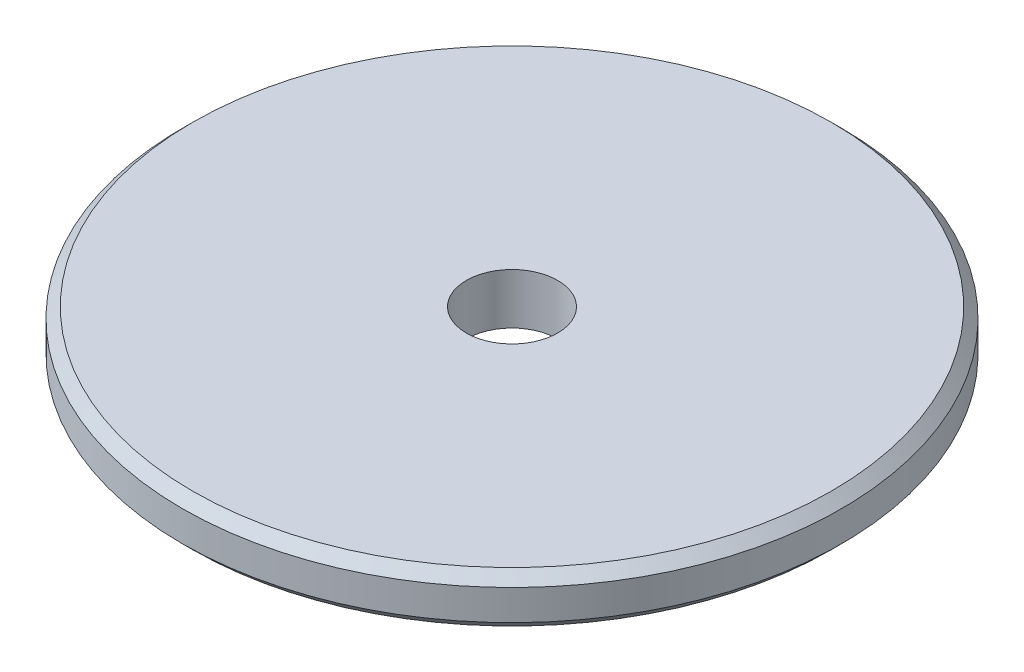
from build123d import *

# Parameters (mm, degrees)
SKETCH1_R      = 32.5
SKETCH1_R_2    = 4.5
EXTRUDE1_DEPTH = 5
CHAMFER1_SIZE  = 1


with BuildPart() as part:
    # Sketch1 → Extrude1 (new body)
    with BuildSketch(Plane(origin=(0, 0, 0), x_dir=(1, 0, 0), z_dir=(0, 1, 0))):
        with Locations(Location((0, 0, 0), (0, 0, 270))):
            Circle(SKETCH1_R)
        with Locations(Location((0, 0, 0), (0, 0, 270))):
            Circle(SKETCH1_R_2, mode=Mode.SUBTRACT)
    extrude(amount=EXTRUDE1_DEPTH)

    # Chamfer1
    chamfer1_edges = [part.edges().sort_by_distance(p)[0] for p in [
        (0, 0, -32.5),
        (0, 5, -32.5),
    ]]
    chamfer(chamfer1_edges, length=CHAMFER1_SIZE)


solid = part.part
